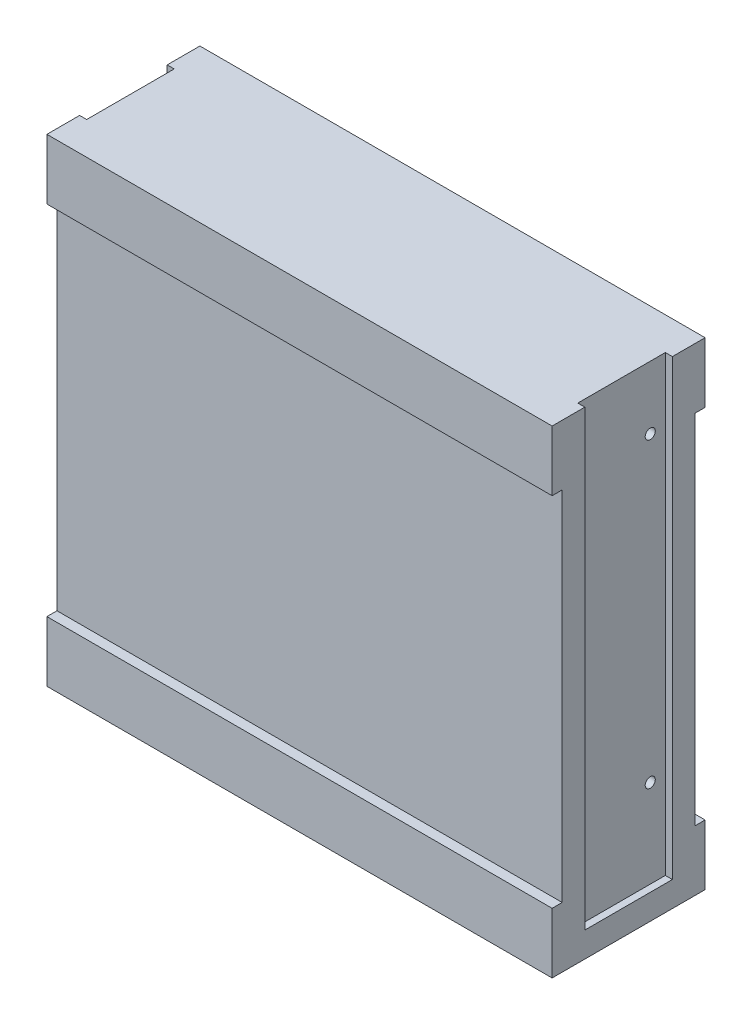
from build123d import *

# Parameters (mm, degrees)
SKETCH1_W           = 100.4
SKETCH1_H           = 95
BOSS_EXTRUDE1_DEPTH = 30.4
SKETCH2_R           = 1
CUT_EXTRUDE1_DEPTH  = 100.4
SKETCH5_W           = 2
SKETCH5_H           = 71
CUT_EXTRUDE4_DEPTH  = 100.4
SKETCH4_W           = 17.4
SKETCH4_H           = 90
CUT_EXTRUDE5_DEPTH  = 1.4
SKETCH3_W           = 17.4
SKETCH3_H           = 90
CUT_EXTRUDE6_DEPTH  = 1.4


with BuildPart() as part:
    # Sketch1 → Boss-Extrude1 (new body)
    with BuildSketch(Plane.XY):
        with Locations((-86.251219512, -4.399390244)):
            Rectangle(SKETCH1_W, SKETCH1_H)
    extrude(amount=BOSS_EXTRUDE1_DEPTH)

    # Sketch2 → Cut-Extrude1 (cut)
    with BuildSketch(Plane(origin=(-36.051219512, 0, 0), x_dir=(0, 0, -1), z_dir=(1, 0, 0))):
        with Locations((-9.5, -29.399390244)):
            Circle(SKETCH2_R)
        with Locations((-9.5, 30.600609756)):
            Circle(SKETCH2_R)
    extrude(amount=-CUT_EXTRUDE1_DEPTH, mode=Mode.SUBTRACT)

    # Sketch5 → Cut-Extrude4 (cut)
    with BuildSketch(Plane(origin=(-36.051219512, 0, 0), x_dir=(0, 0, -1), z_dir=(1, 0, 0))):
        with Locations((-29.4, -4.399390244)):
            Rectangle(SKETCH5_W, SKETCH5_H)
        with Locations((-1, -4.399390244)):
            Rectangle(SKETCH5_W, SKETCH5_H)
    extrude(amount=-CUT_EXTRUDE4_DEPTH, mode=Mode.SUBTRACT)

    # Sketch4 → Cut-Extrude5 (cut)
    with BuildSketch(Plane.ZY.offset(136.451219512)):
        with Locations((15.2, -1.899390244)):
            Rectangle(SKETCH4_W, SKETCH4_H)
    extrude(amount=-CUT_EXTRUDE5_DEPTH, mode=Mode.SUBTRACT)

    # Sketch3 → Cut-Extrude6 (cut)
    with BuildSketch(Plane(origin=(-36.051219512, 0, 0), x_dir=(0, 0, -1), z_dir=(1, 0, 0))):
        with Locations((-15.2, -1.899390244)):
            Rectangle(SKETCH3_W, SKETCH3_H)
    extrude(amount=-CUT_EXTRUDE6_DEPTH, mode=Mode.SUBTRACT)


solid = part.part
